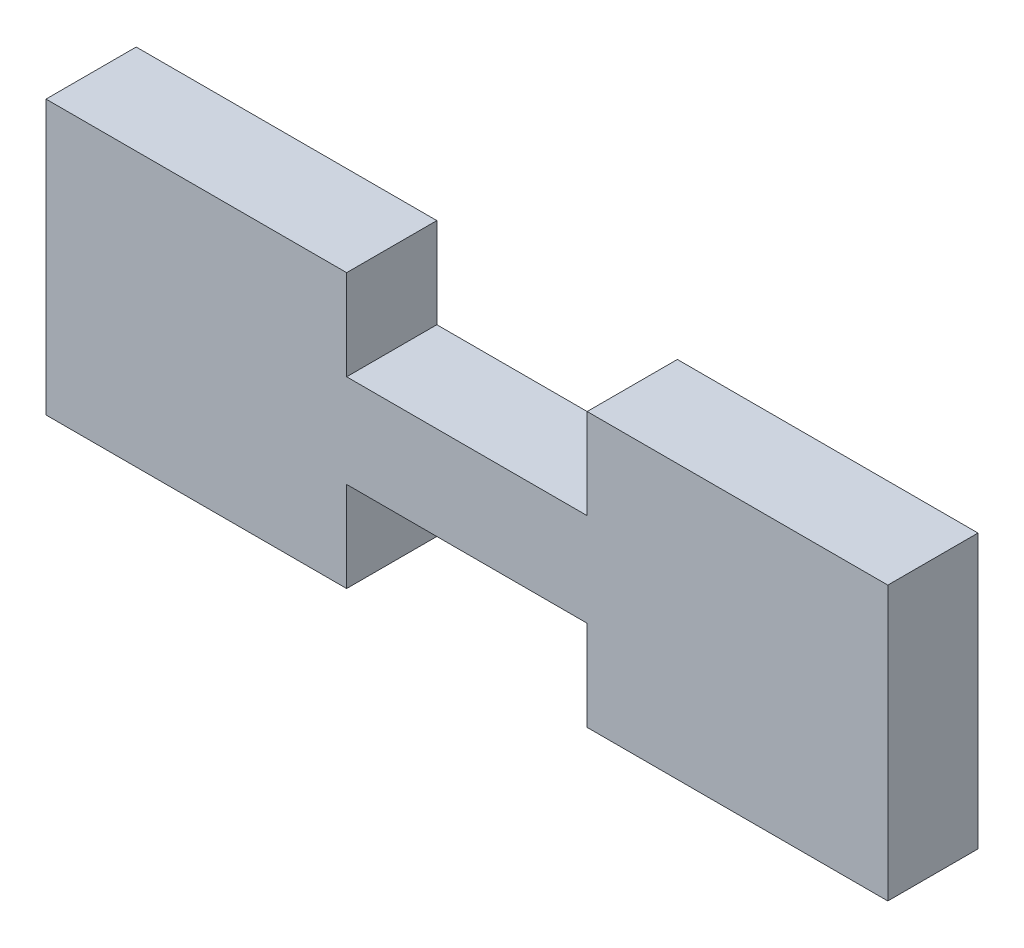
from build123d import *

# Parameters (mm, degrees)
BOSS_EXTRU_1_DEPTH = 3


with BuildPart() as part:
    # Esquisse1 → Boss.-Extru.1 (new body)
    with BuildSketch(Plane.XY):
        Polygon((12.384651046, -3), (12.384651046, 6.1), (22.384651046, 6.1), (22.384651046, 3.1), (30.384651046, 3.1), (30.384651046, 6.1), (40.384651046, 6.1), (40.384651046, -3), (30.384651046, -3), (30.384651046, 0), (22.384651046, 0), (22.384651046, -3), align=None)
    extrude(amount=BOSS_EXTRU_1_DEPTH)


solid = part.part
